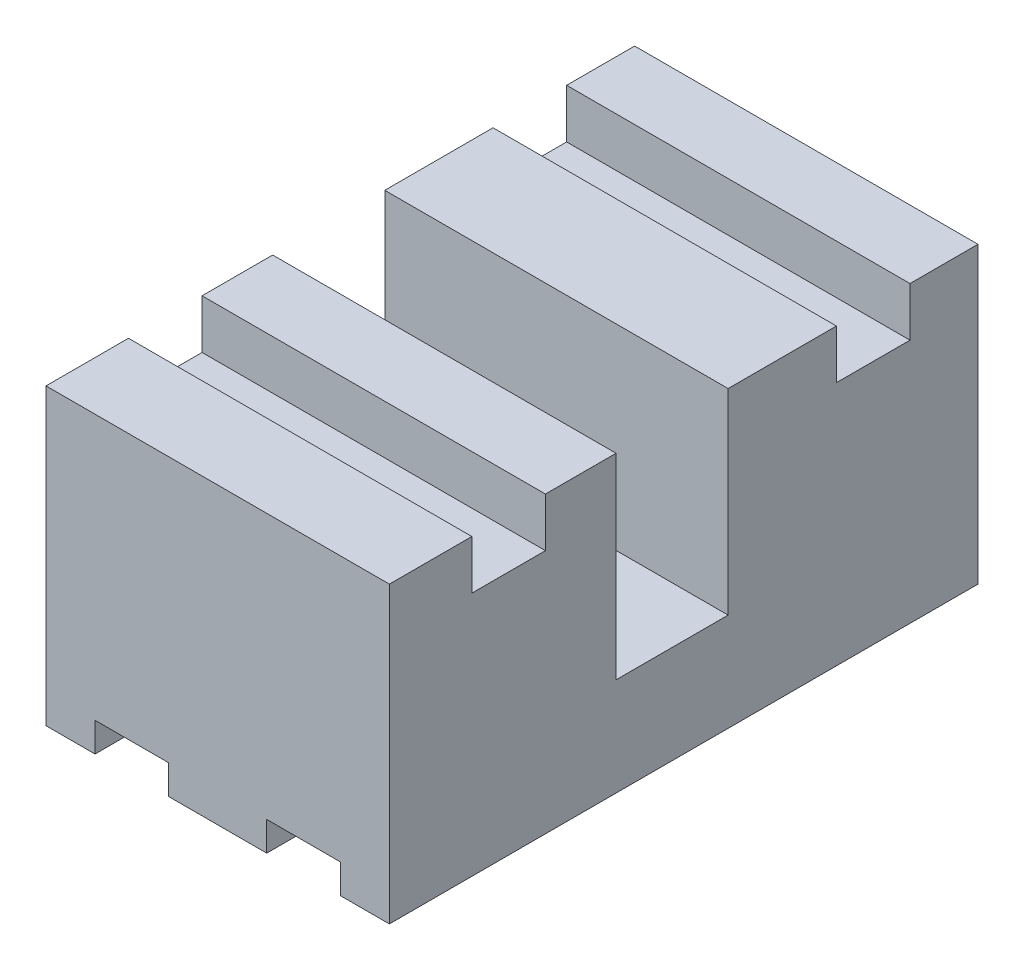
ISO-10303-21;
HEADER;
FILE_DESCRIPTION(('STEP AP214'),'2;1');
FILE_NAME('part.step','',(''),(''),'','','');
FILE_SCHEMA(('AUTOMOTIVE_DESIGN { 1 0 10303 214 1 1 1 1 }'));
ENDSEC;
DATA;
#1=APPLICATION_CONTEXT('core data for automotive mechanical design processes');
#2=APPLICATION_PROTOCOL_DEFINITION('international standard','automotive_design',2000,#1);
#3=PRODUCT_CONTEXT('',#1,'mechanical');
#4=PRODUCT('Part','Part','',(#3));
#5=PRODUCT_RELATED_PRODUCT_CATEGORY('part','',(#4));
#6=PRODUCT_DEFINITION_FORMATION('','',#4);
#7=PRODUCT_DEFINITION_CONTEXT('part definition',#1,'design');
#8=PRODUCT_DEFINITION('design','',#6,#7);
#9=PRODUCT_DEFINITION_SHAPE('','',#8);
#10=(LENGTH_UNIT() NAMED_UNIT(*) SI_UNIT(.MILLI.,.METRE.));
#11=(NAMED_UNIT(*) PLANE_ANGLE_UNIT() SI_UNIT($,.RADIAN.));
#12=(NAMED_UNIT(*) SI_UNIT($,.STERADIAN.) SOLID_ANGLE_UNIT());
#13=UNCERTAINTY_MEASURE_WITH_UNIT(LENGTH_MEASURE(1.E-05),#10,'distance_accuracy_value','');
#14=(GEOMETRIC_REPRESENTATION_CONTEXT(3) GLOBAL_UNCERTAINTY_ASSIGNED_CONTEXT((#13)) GLOBAL_UNIT_ASSIGNED_CONTEXT((#10,
#11,#12)) REPRESENTATION_CONTEXT('',''));
#15=CARTESIAN_POINT('',(0.,0.,0.));
#16=DIRECTION('',(0.,0.,1.));
#17=DIRECTION('',(1.,0.,0.));
#18=AXIS2_PLACEMENT_3D('',#15,#16,#17);
#19=CARTESIAN_POINT('',(175.,50.,300.));
#20=DIRECTION('',(0.,-1.,0.));
#21=DIRECTION('',(1.,0.,0.));
#22=AXIS2_PLACEMENT_3D('',#19,#20,#21);
#23=PLANE('',#22);
#24=DIRECTION('',(0.,0.,-1.));
#25=VECTOR('',#24,1.);
#26=CARTESIAN_POINT('',(0.,50.,300.));
#27=LINE('',#26,#25);
#28=CARTESIAN_POINT('',(0.,50.,184.471740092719));
#29=VERTEX_POINT('',#28);
#30=CARTESIAN_POINT('',(0.,50.,127.352675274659));
#31=VERTEX_POINT('',#30);
#32=EDGE_CURVE('E11',#29,#31,#27,.T.);
#33=ORIENTED_EDGE('',*,*,#32,.F.);
#34=DIRECTION('',(-1.,0.,0.));
#35=VECTOR('',#34,1.);
#36=CARTESIAN_POINT('',(175.,50.,184.471740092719));
#37=LINE('',#36,#35);
#38=CARTESIAN_POINT('',(175.,50.,184.471740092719));
#39=VERTEX_POINT('',#38);
#40=EDGE_CURVE('E242',#39,#29,#37,.T.);
#41=ORIENTED_EDGE('',*,*,#40,.F.);
#42=DIRECTION('',(0.,0.,-1.));
#43=VECTOR('',#42,1.);
#44=CARTESIAN_POINT('',(175.,50.,300.));
#45=LINE('',#44,#43);
#46=CARTESIAN_POINT('',(175.,50.,127.352675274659));
#47=VERTEX_POINT('',#46);
#48=EDGE_CURVE('E153',#39,#47,#45,.T.);
#49=ORIENTED_EDGE('',*,*,#48,.T.);
#50=DIRECTION('',(-1.,0.,0.));
#51=VECTOR('',#50,1.);
#52=CARTESIAN_POINT('',(175.,50.,127.352675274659));
#53=LINE('',#52,#51);
#54=EDGE_CURVE('E189',#47,#31,#53,.T.);
#55=ORIENTED_EDGE('',*,*,#54,.T.);
#56=EDGE_LOOP('',(#33,#41,#49,#55));
#57=FACE_BOUND('',#56,.T.);
#58=ADVANCED_FACE('F32',(#57),#23,.F.);
#59=CARTESIAN_POINT('',(0.,50.,300.));
#60=DIRECTION('',(1.,0.,0.));
#61=DIRECTION('',(0.,1.,0.));
#62=AXIS2_PLACEMENT_3D('',#59,#60,#61);
#63=PLANE('',#62);
#64=DIRECTION('',(0.,-1.,0.));
#65=VECTOR('',#64,1.);
#66=CARTESIAN_POINT('',(0.,50.,0.));
#67=LINE('',#66,#65);
#68=CARTESIAN_POINT('',(0.,150.,0.));
#69=VERTEX_POINT('',#68);
#70=CARTESIAN_POINT('',(0.,0.,0.));
#71=VERTEX_POINT('',#70);
#72=EDGE_CURVE('E154',#69,#71,#67,.T.);
#73=ORIENTED_EDGE('',*,*,#72,.T.);
#74=DIRECTION('',(0.,0.,-1.));
#75=VECTOR('',#74,1.);
#76=CARTESIAN_POINT('',(0.,0.,300.));
#77=LINE('',#76,#75);
#78=CARTESIAN_POINT('',(0.,0.,300.));
#79=VERTEX_POINT('',#78);
#80=EDGE_CURVE('E40',#79,#71,#77,.T.);
#81=ORIENTED_EDGE('',*,*,#80,.F.);
#82=DIRECTION('',(0.,-1.,0.));
#83=VECTOR('',#82,1.);
#84=CARTESIAN_POINT('',(0.,50.,300.));
#85=LINE('',#84,#83);
#86=CARTESIAN_POINT('',(0.,150.,300.));
#87=VERTEX_POINT('',#86);
#88=EDGE_CURVE('E101',#87,#79,#85,.T.);
#89=ORIENTED_EDGE('',*,*,#88,.F.);
#90=DIRECTION('',(0.,0.,-1.));
#91=VECTOR('',#90,1.);
#92=CARTESIAN_POINT('',(0.,150.,300.));
#93=LINE('',#92,#91);
#94=CARTESIAN_POINT('',(0.,150.,257.965859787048));
#95=VERTEX_POINT('',#94);
#96=EDGE_CURVE('E433',#87,#95,#93,.T.);
#97=ORIENTED_EDGE('',*,*,#96,.T.);
#98=DIRECTION('',(0.,-1.,0.));
#99=VECTOR('',#98,1.);
#100=CARTESIAN_POINT('',(0.,150.,257.965859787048));
#101=LINE('',#100,#99);
#102=CARTESIAN_POINT('',(0.,125.,257.965859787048));
#103=VERTEX_POINT('',#102);
#104=EDGE_CURVE('E436',#95,#103,#101,.T.);
#105=ORIENTED_EDGE('',*,*,#104,.T.);
#106=DIRECTION('',(0.,0.,-1.));
#107=VECTOR('',#106,1.);
#108=CARTESIAN_POINT('',(0.,125.,257.965859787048));
#109=LINE('',#108,#107);
#110=CARTESIAN_POINT('',(0.,125.,220.465859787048));
#111=VERTEX_POINT('',#110);
#112=EDGE_CURVE('E439',#103,#111,#109,.T.);
#113=ORIENTED_EDGE('',*,*,#112,.T.);
#114=DIRECTION('',(0.,1.,0.));
#115=VECTOR('',#114,1.);
#116=CARTESIAN_POINT('',(0.,125.,220.465859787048));
#117=LINE('',#116,#115);
#118=CARTESIAN_POINT('',(0.,150.,220.465859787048));
#119=VERTEX_POINT('',#118);
#120=EDGE_CURVE('E442',#111,#119,#117,.T.);
#121=ORIENTED_EDGE('',*,*,#120,.T.);
#122=DIRECTION('',(0.,0.,-1.));
#123=VECTOR('',#122,1.);
#124=CARTESIAN_POINT('',(0.,150.,220.465859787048));
#125=LINE('',#124,#123);
#126=CARTESIAN_POINT('',(0.,150.,184.471740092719));
#127=VERTEX_POINT('',#126);
#128=EDGE_CURVE('E415',#119,#127,#125,.T.);
#129=ORIENTED_EDGE('',*,*,#128,.T.);
#130=DIRECTION('',(0.,-1.,0.));
#131=VECTOR('',#130,1.);
#132=CARTESIAN_POINT('',(0.,150.,184.471740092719));
#133=LINE('',#132,#131);
#134=EDGE_CURVE('E259',#127,#29,#133,.T.);
#135=ORIENTED_EDGE('',*,*,#134,.T.);
#136=ORIENTED_EDGE('',*,*,#32,.T.);
#137=DIRECTION('',(0.,1.,0.));
#138=VECTOR('',#137,1.);
#139=CARTESIAN_POINT('',(0.,150.,127.352675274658));
#140=LINE('',#139,#138);
#141=CARTESIAN_POINT('',(0.,150.,127.352675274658));
#142=VERTEX_POINT('',#141);
#143=EDGE_CURVE('E240',#31,#142,#140,.T.);
#144=ORIENTED_EDGE('',*,*,#143,.T.);
#145=DIRECTION('',(0.,0.,-1.));
#146=VECTOR('',#145,1.);
#147=CARTESIAN_POINT('',(0.,150.,72.1566484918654));
#148=LINE('',#147,#146);
#149=CARTESIAN_POINT('',(0.,150.,72.1566484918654));
#150=VERTEX_POINT('',#149);
#151=EDGE_CURVE('E241',#142,#150,#148,.T.);
#152=ORIENTED_EDGE('',*,*,#151,.T.);
#153=DIRECTION('',(0.,-1.,0.));
#154=VECTOR('',#153,1.);
#155=CARTESIAN_POINT('',(0.,125.,72.1566484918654));
#156=LINE('',#155,#154);
#157=CARTESIAN_POINT('',(0.,125.,72.1566484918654));
#158=VERTEX_POINT('',#157);
#159=EDGE_CURVE('E245',#150,#158,#156,.T.);
#160=ORIENTED_EDGE('',*,*,#159,.T.);
#161=DIRECTION('',(0.,0.,-1.));
#162=VECTOR('',#161,1.);
#163=CARTESIAN_POINT('',(0.,125.,34.6566484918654));
#164=LINE('',#163,#162);
#165=CARTESIAN_POINT('',(0.,125.,34.6566484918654));
#166=VERTEX_POINT('',#165);
#167=EDGE_CURVE('E291',#158,#166,#164,.T.);
#168=ORIENTED_EDGE('',*,*,#167,.T.);
#169=DIRECTION('',(0.,1.,0.));
#170=VECTOR('',#169,1.);
#171=CARTESIAN_POINT('',(0.,150.,34.6566484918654));
#172=LINE('',#171,#170);
#173=CARTESIAN_POINT('',(0.,150.,34.6566484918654));
#174=VERTEX_POINT('',#173);
#175=EDGE_CURVE('E294',#166,#174,#172,.T.);
#176=ORIENTED_EDGE('',*,*,#175,.T.);
#177=DIRECTION('',(0.,0.,-1.));
#178=VECTOR('',#177,1.);
#179=CARTESIAN_POINT('',(0.,150.,0.));
#180=LINE('',#179,#178);
#181=EDGE_CURVE('E188',#174,#69,#180,.T.);
#182=ORIENTED_EDGE('',*,*,#181,.T.);
#183=EDGE_LOOP('',(#73,#81,#89,#97,#105,#113,#121,#129,#135,#136,#144,#152,#160,#168,#176,#182));
#184=FACE_BOUND('',#183,.T.);
#185=ADVANCED_FACE('F327',(#184),#63,.F.);
#186=CARTESIAN_POINT('',(0.,0.,300.));
#187=DIRECTION('',(0.,1.,0.));
#188=DIRECTION('',(0.,0.,1.));
#189=AXIS2_PLACEMENT_3D('',#186,#187,#188);
#190=PLANE('',#189);
#191=DIRECTION('',(1.,0.,0.));
#192=VECTOR('',#191,1.);
#193=CARTESIAN_POINT('',(0.,0.,0.));
#194=LINE('',#193,#192);
#195=CARTESIAN_POINT('',(25.,0.,0.));
#196=VERTEX_POINT('',#195);
#197=EDGE_CURVE('E156',#71,#196,#194,.T.);
#198=ORIENTED_EDGE('',*,*,#197,.T.);
#199=DIRECTION('',(0.,0.,-1.));
#200=VECTOR('',#199,1.);
#201=CARTESIAN_POINT('',(25.,0.,300.));
#202=LINE('',#201,#200);
#203=CARTESIAN_POINT('',(25.,0.,300.));
#204=VERTEX_POINT('',#203);
#205=EDGE_CURVE('E235',#204,#196,#202,.T.);
#206=ORIENTED_EDGE('',*,*,#205,.F.);
#207=DIRECTION('',(1.,0.,0.));
#208=VECTOR('',#207,1.);
#209=CARTESIAN_POINT('',(0.,0.,300.));
#210=LINE('',#209,#208);
#211=EDGE_CURVE('E202',#79,#204,#210,.T.);
#212=ORIENTED_EDGE('',*,*,#211,.F.);
#213=ORIENTED_EDGE('',*,*,#80,.T.);
#214=EDGE_LOOP('',(#198,#206,#212,#213));
#215=FACE_BOUND('',#214,.T.);
#216=ADVANCED_FACE('F469',(#215),#190,.F.);
#217=CARTESIAN_POINT('',(25.,0.,300.));
#218=DIRECTION('',(-1.,0.,0.));
#219=DIRECTION('',(0.,0.,1.));
#220=AXIS2_PLACEMENT_3D('',#217,#218,#219);
#221=PLANE('',#220);
#222=DIRECTION('',(0.,1.,0.));
#223=VECTOR('',#222,1.);
#224=CARTESIAN_POINT('',(25.,0.,0.));
#225=LINE('',#224,#223);
#226=CARTESIAN_POINT('',(25.,14.8994379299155,0.));
#227=VERTEX_POINT('',#226);
#228=EDGE_CURVE('E159',#196,#227,#225,.T.);
#229=ORIENTED_EDGE('',*,*,#228,.T.);
#230=DIRECTION('',(0.,0.,-1.));
#231=VECTOR('',#230,1.);
#232=CARTESIAN_POINT('',(25.,14.8994379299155,300.));
#233=LINE('',#232,#231);
#234=CARTESIAN_POINT('',(25.,14.8994379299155,300.));
#235=VERTEX_POINT('',#234);
#236=EDGE_CURVE('E232',#235,#227,#233,.T.);
#237=ORIENTED_EDGE('',*,*,#236,.F.);
#238=DIRECTION('',(0.,1.,0.));
#239=VECTOR('',#238,1.);
#240=CARTESIAN_POINT('',(25.,0.,300.));
#241=LINE('',#240,#239);
#242=EDGE_CURVE('E204',#204,#235,#241,.T.);
#243=ORIENTED_EDGE('',*,*,#242,.F.);
#244=ORIENTED_EDGE('',*,*,#205,.T.);
#245=EDGE_LOOP('',(#229,#237,#243,#244));
#246=FACE_BOUND('',#245,.T.);
#247=ADVANCED_FACE('F473',(#246),#221,.F.);
#248=CARTESIAN_POINT('',(25.,14.8994379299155,300.));
#249=DIRECTION('',(0.,1.,0.));
#250=DIRECTION('',(0.,0.,1.));
#251=AXIS2_PLACEMENT_3D('',#248,#249,#250);
#252=PLANE('',#251);
#253=DIRECTION('',(1.,0.,0.));
#254=VECTOR('',#253,1.);
#255=CARTESIAN_POINT('',(25.,14.8994379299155,0.));
#256=LINE('',#255,#254);
#257=CARTESIAN_POINT('',(62.5,14.8994379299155,0.));
#258=VERTEX_POINT('',#257);
#259=EDGE_CURVE('E161',#227,#258,#256,.T.);
#260=ORIENTED_EDGE('',*,*,#259,.T.);
#261=DIRECTION('',(0.,0.,-1.));
#262=VECTOR('',#261,1.);
#263=CARTESIAN_POINT('',(62.5,14.8994379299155,300.));
#264=LINE('',#263,#262);
#265=CARTESIAN_POINT('',(62.5,14.8994379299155,300.));
#266=VERTEX_POINT('',#265);
#267=EDGE_CURVE('E229',#266,#258,#264,.T.);
#268=ORIENTED_EDGE('',*,*,#267,.F.);
#269=DIRECTION('',(1.,0.,0.));
#270=VECTOR('',#269,1.);
#271=CARTESIAN_POINT('',(25.,14.8994379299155,300.));
#272=LINE('',#271,#270);
#273=EDGE_CURVE('E206',#235,#266,#272,.T.);
#274=ORIENTED_EDGE('',*,*,#273,.F.);
#275=ORIENTED_EDGE('',*,*,#236,.T.);
#276=EDGE_LOOP('',(#260,#268,#274,#275));
#277=FACE_BOUND('',#276,.T.);
#278=ADVANCED_FACE('F479',(#277),#252,.F.);
#279=CARTESIAN_POINT('',(62.5,14.8994379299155,300.));
#280=DIRECTION('',(1.,0.,0.));
#281=DIRECTION('',(0.,1.,0.));
#282=AXIS2_PLACEMENT_3D('',#279,#280,#281);
#283=PLANE('',#282);
#284=DIRECTION('',(0.,-1.,0.));
#285=VECTOR('',#284,1.);
#286=CARTESIAN_POINT('',(62.5,14.8994379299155,0.));
#287=LINE('',#286,#285);
#288=CARTESIAN_POINT('',(62.5,0.,0.));
#289=VERTEX_POINT('',#288);
#290=EDGE_CURVE('E163',#258,#289,#287,.T.);
#291=ORIENTED_EDGE('',*,*,#290,.T.);
#292=DIRECTION('',(0.,0.,-1.));
#293=VECTOR('',#292,1.);
#294=CARTESIAN_POINT('',(62.5,0.,300.));
#295=LINE('',#294,#293);
#296=CARTESIAN_POINT('',(62.5,0.,300.));
#297=VERTEX_POINT('',#296);
#298=EDGE_CURVE('E223',#297,#289,#295,.T.);
#299=ORIENTED_EDGE('',*,*,#298,.F.);
#300=DIRECTION('',(0.,-1.,0.));
#301=VECTOR('',#300,1.);
#302=CARTESIAN_POINT('',(62.5,14.8994379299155,300.));
#303=LINE('',#302,#301);
#304=EDGE_CURVE('E208',#266,#297,#303,.T.);
#305=ORIENTED_EDGE('',*,*,#304,.F.);
#306=ORIENTED_EDGE('',*,*,#267,.T.);
#307=EDGE_LOOP('',(#291,#299,#305,#306));
#308=FACE_BOUND('',#307,.T.);
#309=ADVANCED_FACE('F483',(#308),#283,.F.);
#310=CARTESIAN_POINT('',(62.5,0.,300.));
#311=DIRECTION('',(0.,1.,0.));
#312=DIRECTION('',(0.,0.,1.));
#313=AXIS2_PLACEMENT_3D('',#310,#311,#312);
#314=PLANE('',#313);
#315=DIRECTION('',(1.,0.,0.));
#316=VECTOR('',#315,1.);
#317=CARTESIAN_POINT('',(62.5,0.,0.));
#318=LINE('',#317,#316);
#319=CARTESIAN_POINT('',(112.5,0.,0.));
#320=VERTEX_POINT('',#319);
#321=EDGE_CURVE('E165',#289,#320,#318,.T.);
#322=ORIENTED_EDGE('',*,*,#321,.T.);
#323=DIRECTION('',(0.,0.,-1.));
#324=VECTOR('',#323,1.);
#325=CARTESIAN_POINT('',(112.5,0.,300.));
#326=LINE('',#325,#324);
#327=CARTESIAN_POINT('',(112.5,0.,300.));
#328=VERTEX_POINT('',#327);
#329=EDGE_CURVE('E218',#328,#320,#326,.T.);
#330=ORIENTED_EDGE('',*,*,#329,.F.);
#331=DIRECTION('',(1.,0.,0.));
#332=VECTOR('',#331,1.);
#333=CARTESIAN_POINT('',(62.5,0.,300.));
#334=LINE('',#333,#332);
#335=EDGE_CURVE('E210',#297,#328,#334,.T.);
#336=ORIENTED_EDGE('',*,*,#335,.F.);
#337=ORIENTED_EDGE('',*,*,#298,.T.);
#338=EDGE_LOOP('',(#322,#330,#336,#337));
#339=FACE_BOUND('',#338,.T.);
#340=ADVANCED_FACE('F219',(#339),#314,.F.);
#341=CARTESIAN_POINT('',(112.5,0.,300.));
#342=DIRECTION('',(-1.,0.,0.));
#343=DIRECTION('',(0.,0.,1.));
#344=AXIS2_PLACEMENT_3D('',#341,#342,#343);
#345=PLANE('',#344);
#346=DIRECTION('',(0.,1.,0.));
#347=VECTOR('',#346,1.);
#348=CARTESIAN_POINT('',(112.5,0.,0.));
#349=LINE('',#348,#347);
#350=CARTESIAN_POINT('',(112.5,14.8994379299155,0.));
#351=VERTEX_POINT('',#350);
#352=EDGE_CURVE('E167',#320,#351,#349,.T.);
#353=ORIENTED_EDGE('',*,*,#352,.T.);
#354=DIRECTION('',(0.,0.,-1.));
#355=VECTOR('',#354,1.);
#356=CARTESIAN_POINT('',(112.5,14.8994379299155,300.));
#357=LINE('',#356,#355);
#358=CARTESIAN_POINT('',(112.5,14.8994379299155,300.));
#359=VERTEX_POINT('',#358);
#360=EDGE_CURVE('E143',#359,#351,#357,.T.);
#361=ORIENTED_EDGE('',*,*,#360,.F.);
#362=DIRECTION('',(0.,1.,0.));
#363=VECTOR('',#362,1.);
#364=CARTESIAN_POINT('',(112.5,0.,300.));
#365=LINE('',#364,#363);
#366=EDGE_CURVE('E131',#328,#359,#365,.T.);
#367=ORIENTED_EDGE('',*,*,#366,.F.);
#368=ORIENTED_EDGE('',*,*,#329,.T.);
#369=EDGE_LOOP('',(#353,#361,#367,#368));
#370=FACE_BOUND('',#369,.T.);
#371=ADVANCED_FACE('F225',(#370),#345,.F.);
#372=CARTESIAN_POINT('',(112.5,14.8994379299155,300.));
#373=DIRECTION('',(0.,1.,0.));
#374=DIRECTION('',(0.,0.,1.));
#375=AXIS2_PLACEMENT_3D('',#372,#373,#374);
#376=PLANE('',#375);
#377=DIRECTION('',(1.,0.,0.));
#378=VECTOR('',#377,1.);
#379=CARTESIAN_POINT('',(112.5,14.8994379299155,0.));
#380=LINE('',#379,#378);
#381=CARTESIAN_POINT('',(150.,14.8994379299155,0.));
#382=VERTEX_POINT('',#381);
#383=EDGE_CURVE('E140',#351,#382,#380,.T.);
#384=ORIENTED_EDGE('',*,*,#383,.T.);
#385=DIRECTION('',(0.,0.,-1.));
#386=VECTOR('',#385,1.);
#387=CARTESIAN_POINT('',(150.,14.8994379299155,300.));
#388=LINE('',#387,#386);
#389=CARTESIAN_POINT('',(150.,14.8994379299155,300.));
#390=VERTEX_POINT('',#389);
#391=EDGE_CURVE('E137',#390,#382,#388,.T.);
#392=ORIENTED_EDGE('',*,*,#391,.F.);
#393=DIRECTION('',(1.,0.,0.));
#394=VECTOR('',#393,1.);
#395=CARTESIAN_POINT('',(112.5,14.8994379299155,300.));
#396=LINE('',#395,#394);
#397=EDGE_CURVE('E124',#359,#390,#396,.T.);
#398=ORIENTED_EDGE('',*,*,#397,.F.);
#399=ORIENTED_EDGE('',*,*,#360,.T.);
#400=EDGE_LOOP('',(#384,#392,#398,#399));
#401=FACE_BOUND('',#400,.T.);
#402=ADVANCED_FACE('F138',(#401),#376,.F.);
#403=CARTESIAN_POINT('',(150.,14.8994379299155,300.));
#404=DIRECTION('',(1.,0.,0.));
#405=DIRECTION('',(0.,0.,-1.));
#406=AXIS2_PLACEMENT_3D('',#403,#404,#405);
#407=PLANE('',#406);
#408=DIRECTION('',(0.,-1.,0.));
#409=VECTOR('',#408,1.);
#410=CARTESIAN_POINT('',(150.,14.8994379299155,0.));
#411=LINE('',#410,#409);
#412=CARTESIAN_POINT('',(150.,0.,0.));
#413=VERTEX_POINT('',#412);
#414=EDGE_CURVE('E170',#382,#413,#411,.T.);
#415=ORIENTED_EDGE('',*,*,#414,.T.);
#416=DIRECTION('',(0.,0.,-1.));
#417=VECTOR('',#416,1.);
#418=CARTESIAN_POINT('',(150.,0.,300.));
#419=LINE('',#418,#417);
#420=CARTESIAN_POINT('',(150.,0.,300.));
#421=VERTEX_POINT('',#420);
#422=EDGE_CURVE('E144',#421,#413,#419,.T.);
#423=ORIENTED_EDGE('',*,*,#422,.F.);
#424=DIRECTION('',(0.,-1.,0.));
#425=VECTOR('',#424,1.);
#426=CARTESIAN_POINT('',(150.,14.8994379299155,300.));
#427=LINE('',#426,#425);
#428=EDGE_CURVE('E128',#390,#421,#427,.T.);
#429=ORIENTED_EDGE('',*,*,#428,.F.);
#430=ORIENTED_EDGE('',*,*,#391,.T.);
#431=EDGE_LOOP('',(#415,#423,#429,#430));
#432=FACE_BOUND('',#431,.T.);
#433=ADVANCED_FACE('F146',(#432),#407,.F.);
#434=CARTESIAN_POINT('',(150.,0.,300.));
#435=DIRECTION('',(0.,1.,0.));
#436=DIRECTION('',(0.,0.,1.));
#437=AXIS2_PLACEMENT_3D('',#434,#435,#436);
#438=PLANE('',#437);
#439=DIRECTION('',(1.,0.,0.));
#440=VECTOR('',#439,1.);
#441=CARTESIAN_POINT('',(150.,0.,0.));
#442=LINE('',#441,#440);
#443=CARTESIAN_POINT('',(175.,0.,0.));
#444=VERTEX_POINT('',#443);
#445=EDGE_CURVE('E93',#413,#444,#442,.T.);
#446=ORIENTED_EDGE('',*,*,#445,.T.);
#447=DIRECTION('',(0.,0.,-1.));
#448=VECTOR('',#447,1.);
#449=CARTESIAN_POINT('',(175.,0.,300.));
#450=LINE('',#449,#448);
#451=CARTESIAN_POINT('',(175.,0.,300.));
#452=VERTEX_POINT('',#451);
#453=EDGE_CURVE('E178',#452,#444,#450,.T.);
#454=ORIENTED_EDGE('',*,*,#453,.F.);
#455=DIRECTION('',(1.,0.,0.));
#456=VECTOR('',#455,1.);
#457=CARTESIAN_POINT('',(150.,0.,300.));
#458=LINE('',#457,#456);
#459=EDGE_CURVE('E54',#421,#452,#458,.T.);
#460=ORIENTED_EDGE('',*,*,#459,.F.);
#461=ORIENTED_EDGE('',*,*,#422,.T.);
#462=EDGE_LOOP('',(#446,#454,#460,#461));
#463=FACE_BOUND('',#462,.T.);
#464=ADVANCED_FACE('F496',(#463),#438,.F.);
#465=CARTESIAN_POINT('',(175.,0.,300.));
#466=DIRECTION('',(-1.,0.,0.));
#467=DIRECTION('',(0.,0.,1.));
#468=AXIS2_PLACEMENT_3D('',#465,#466,#467);
#469=PLANE('',#468);
#470=DIRECTION('',(0.,1.,0.));
#471=VECTOR('',#470,1.);
#472=CARTESIAN_POINT('',(175.,0.,0.));
#473=LINE('',#472,#471);
#474=CARTESIAN_POINT('',(175.,150.,0.));
#475=VERTEX_POINT('',#474);
#476=EDGE_CURVE('E173',#444,#475,#473,.T.);
#477=ORIENTED_EDGE('',*,*,#476,.T.);
#478=DIRECTION('',(0.,0.,-1.));
#479=VECTOR('',#478,1.);
#480=CARTESIAN_POINT('',(175.,150.,0.));
#481=LINE('',#480,#479);
#482=CARTESIAN_POINT('',(175.,150.,34.6566484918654));
#483=VERTEX_POINT('',#482);
#484=EDGE_CURVE('E194',#483,#475,#481,.T.);
#485=ORIENTED_EDGE('',*,*,#484,.F.);
#486=DIRECTION('',(0.,1.,0.));
#487=VECTOR('',#486,1.);
#488=CARTESIAN_POINT('',(175.,150.,34.6566484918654));
#489=LINE('',#488,#487);
#490=CARTESIAN_POINT('',(175.,125.,34.6566484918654));
#491=VERTEX_POINT('',#490);
#492=EDGE_CURVE('E284',#491,#483,#489,.T.);
#493=ORIENTED_EDGE('',*,*,#492,.F.);
#494=DIRECTION('',(0.,0.,-1.));
#495=VECTOR('',#494,1.);
#496=CARTESIAN_POINT('',(175.,125.,34.6566484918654));
#497=LINE('',#496,#495);
#498=CARTESIAN_POINT('',(175.,125.,72.1566484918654));
#499=VERTEX_POINT('',#498);
#500=EDGE_CURVE('E281',#499,#491,#497,.T.);
#501=ORIENTED_EDGE('',*,*,#500,.F.);
#502=DIRECTION('',(0.,-1.,0.));
#503=VECTOR('',#502,1.);
#504=CARTESIAN_POINT('',(175.,125.,72.1566484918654));
#505=LINE('',#504,#503);
#506=CARTESIAN_POINT('',(175.,150.,72.1566484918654));
#507=VERTEX_POINT('',#506);
#508=EDGE_CURVE('E278',#507,#499,#505,.T.);
#509=ORIENTED_EDGE('',*,*,#508,.F.);
#510=DIRECTION('',(0.,0.,-1.));
#511=VECTOR('',#510,1.);
#512=CARTESIAN_POINT('',(175.,150.,72.1566484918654));
#513=LINE('',#512,#511);
#514=CARTESIAN_POINT('',(175.,150.,127.352675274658));
#515=VERTEX_POINT('',#514);
#516=EDGE_CURVE('E187',#515,#507,#513,.T.);
#517=ORIENTED_EDGE('',*,*,#516,.F.);
#518=DIRECTION('',(0.,1.,0.));
#519=VECTOR('',#518,1.);
#520=CARTESIAN_POINT('',(175.,150.,127.352675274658));
#521=LINE('',#520,#519);
#522=EDGE_CURVE('E184',#47,#515,#521,.T.);
#523=ORIENTED_EDGE('',*,*,#522,.F.);
#524=ORIENTED_EDGE('',*,*,#48,.F.);
#525=DIRECTION('',(0.,-1.,0.));
#526=VECTOR('',#525,1.);
#527=CARTESIAN_POINT('',(175.,150.,184.471740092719));
#528=LINE('',#527,#526);
#529=CARTESIAN_POINT('',(175.,150.,184.471740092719));
#530=VERTEX_POINT('',#529);
#531=EDGE_CURVE('E275',#530,#39,#528,.T.);
#532=ORIENTED_EDGE('',*,*,#531,.F.);
#533=DIRECTION('',(0.,0.,-1.));
#534=VECTOR('',#533,1.);
#535=CARTESIAN_POINT('',(175.,150.,220.465859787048));
#536=LINE('',#535,#534);
#537=CARTESIAN_POINT('',(175.,150.,220.465859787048));
#538=VERTEX_POINT('',#537);
#539=EDGE_CURVE('E414',#538,#530,#536,.T.);
#540=ORIENTED_EDGE('',*,*,#539,.F.);
#541=DIRECTION('',(0.,1.,0.));
#542=VECTOR('',#541,1.);
#543=CARTESIAN_POINT('',(175.,125.,220.465859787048));
#544=LINE('',#543,#542);
#545=CARTESIAN_POINT('',(175.,125.,220.465859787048));
#546=VERTEX_POINT('',#545);
#547=EDGE_CURVE('E422',#546,#538,#544,.T.);
#548=ORIENTED_EDGE('',*,*,#547,.F.);
#549=DIRECTION('',(0.,0.,-1.));
#550=VECTOR('',#549,1.);
#551=CARTESIAN_POINT('',(175.,125.,257.965859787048));
#552=LINE('',#551,#550);
#553=CARTESIAN_POINT('',(175.,125.,257.965859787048));
#554=VERTEX_POINT('',#553);
#555=EDGE_CURVE('E426',#554,#546,#552,.T.);
#556=ORIENTED_EDGE('',*,*,#555,.F.);
#557=DIRECTION('',(0.,-1.,0.));
#558=VECTOR('',#557,1.);
#559=CARTESIAN_POINT('',(175.,150.,257.965859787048));
#560=LINE('',#559,#558);
#561=CARTESIAN_POINT('',(175.,150.,257.965859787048));
#562=VERTEX_POINT('',#561);
#563=EDGE_CURVE('E428',#562,#554,#560,.T.);
#564=ORIENTED_EDGE('',*,*,#563,.F.);
#565=DIRECTION('',(0.,0.,-1.));
#566=VECTOR('',#565,1.);
#567=CARTESIAN_POINT('',(175.,150.,300.));
#568=LINE('',#567,#566);
#569=CARTESIAN_POINT('',(175.,150.,300.));
#570=VERTEX_POINT('',#569);
#571=EDGE_CURVE('E443',#570,#562,#568,.T.);
#572=ORIENTED_EDGE('',*,*,#571,.F.);
#573=DIRECTION('',(0.,1.,0.));
#574=VECTOR('',#573,1.);
#575=CARTESIAN_POINT('',(175.,0.,300.));
#576=LINE('',#575,#574);
#577=EDGE_CURVE('E148',#452,#570,#576,.T.);
#578=ORIENTED_EDGE('',*,*,#577,.F.);
#579=ORIENTED_EDGE('',*,*,#453,.T.);
#580=EDGE_LOOP('',(#477,#485,#493,#501,#509,#517,#523,#524,#532,#540,#548,#556,#564,#572,#578,#579));
#581=FACE_BOUND('',#580,.T.);
#582=ADVANCED_FACE('F363',(#581),#469,.F.);
#583=CARTESIAN_POINT('',(0.,50.,300.));
#584=DIRECTION('',(0.,0.,1.));
#585=DIRECTION('',(1.,0.,0.));
#586=AXIS2_PLACEMENT_3D('',#583,#584,#585);
#587=PLANE('',#586);
#588=ORIENTED_EDGE('',*,*,#577,.T.);
#589=DIRECTION('',(-1.,0.,0.));
#590=VECTOR('',#589,1.);
#591=CARTESIAN_POINT('',(175.,150.,300.));
#592=LINE('',#591,#590);
#593=EDGE_CURVE('E273',#570,#87,#592,.T.);
#594=ORIENTED_EDGE('',*,*,#593,.T.);
#595=ORIENTED_EDGE('',*,*,#88,.T.);
#596=ORIENTED_EDGE('',*,*,#211,.T.);
#597=ORIENTED_EDGE('',*,*,#242,.T.);
#598=ORIENTED_EDGE('',*,*,#273,.T.);
#599=ORIENTED_EDGE('',*,*,#304,.T.);
#600=ORIENTED_EDGE('',*,*,#335,.T.);
#601=ORIENTED_EDGE('',*,*,#366,.T.);
#602=ORIENTED_EDGE('',*,*,#397,.T.);
#603=ORIENTED_EDGE('',*,*,#428,.T.);
#604=ORIENTED_EDGE('',*,*,#459,.T.);
#605=EDGE_LOOP('',(#588,#594,#595,#596,#597,#598,#599,#600,#601,#602,#603,#604));
#606=FACE_BOUND('',#605,.T.);
#607=ADVANCED_FACE('F126',(#606),#587,.T.);
#608=CARTESIAN_POINT('',(0.,50.,0.));
#609=DIRECTION('',(0.,0.,1.));
#610=DIRECTION('',(1.,0.,0.));
#611=AXIS2_PLACEMENT_3D('',#608,#609,#610);
#612=PLANE('',#611);
#613=ORIENTED_EDGE('',*,*,#72,.F.);
#614=DIRECTION('',(-1.,0.,0.));
#615=VECTOR('',#614,1.);
#616=CARTESIAN_POINT('',(175.,150.,0.));
#617=LINE('',#616,#615);
#618=EDGE_CURVE('E157',#475,#69,#617,.T.);
#619=ORIENTED_EDGE('',*,*,#618,.F.);
#620=ORIENTED_EDGE('',*,*,#476,.F.);
#621=ORIENTED_EDGE('',*,*,#445,.F.);
#622=ORIENTED_EDGE('',*,*,#414,.F.);
#623=ORIENTED_EDGE('',*,*,#383,.F.);
#624=ORIENTED_EDGE('',*,*,#352,.F.);
#625=ORIENTED_EDGE('',*,*,#321,.F.);
#626=ORIENTED_EDGE('',*,*,#290,.F.);
#627=ORIENTED_EDGE('',*,*,#259,.F.);
#628=ORIENTED_EDGE('',*,*,#228,.F.);
#629=ORIENTED_EDGE('',*,*,#197,.F.);
#630=EDGE_LOOP('',(#613,#619,#620,#621,#622,#623,#624,#625,#626,#627,#628,#629));
#631=FACE_BOUND('',#630,.T.);
#632=ADVANCED_FACE('F366',(#631),#612,.F.);
#633=CARTESIAN_POINT('',(175.,150.,0.));
#634=DIRECTION('',(0.,1.,0.));
#635=DIRECTION('',(-1.,0.,0.));
#636=AXIS2_PLACEMENT_3D('',#633,#634,#635);
#637=PLANE('',#636);
#638=ORIENTED_EDGE('',*,*,#181,.F.);
#639=DIRECTION('',(-1.,0.,0.));
#640=VECTOR('',#639,1.);
#641=CARTESIAN_POINT('',(175.,150.,34.6566484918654));
#642=LINE('',#641,#640);
#643=EDGE_CURVE('E301',#483,#174,#642,.T.);
#644=ORIENTED_EDGE('',*,*,#643,.F.);
#645=ORIENTED_EDGE('',*,*,#484,.T.);
#646=ORIENTED_EDGE('',*,*,#618,.T.);
#647=EDGE_LOOP('',(#638,#644,#645,#646));
#648=FACE_BOUND('',#647,.T.);
#649=ADVANCED_FACE('F368',(#648),#637,.T.);
#650=CARTESIAN_POINT('',(175.,150.,34.6566484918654));
#651=DIRECTION('',(0.,0.,1.));
#652=DIRECTION('',(0.,-1.,0.));
#653=AXIS2_PLACEMENT_3D('',#650,#651,#652);
#654=PLANE('',#653);
#655=ORIENTED_EDGE('',*,*,#175,.F.);
#656=DIRECTION('',(-1.,0.,0.));
#657=VECTOR('',#656,1.);
#658=CARTESIAN_POINT('',(175.,125.,34.6566484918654));
#659=LINE('',#658,#657);
#660=EDGE_CURVE('E304',#491,#166,#659,.T.);
#661=ORIENTED_EDGE('',*,*,#660,.F.);
#662=ORIENTED_EDGE('',*,*,#492,.T.);
#663=ORIENTED_EDGE('',*,*,#643,.T.);
#664=EDGE_LOOP('',(#655,#661,#662,#663));
#665=FACE_BOUND('',#664,.T.);
#666=ADVANCED_FACE('F370',(#665),#654,.T.);
#667=CARTESIAN_POINT('',(175.,125.,34.6566484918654));
#668=DIRECTION('',(0.,1.,0.));
#669=DIRECTION('',(-1.,0.,0.));
#670=AXIS2_PLACEMENT_3D('',#667,#668,#669);
#671=PLANE('',#670);
#672=ORIENTED_EDGE('',*,*,#167,.F.);
#673=DIRECTION('',(-1.,0.,0.));
#674=VECTOR('',#673,1.);
#675=CARTESIAN_POINT('',(175.,125.,72.1566484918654));
#676=LINE('',#675,#674);
#677=EDGE_CURVE('E307',#499,#158,#676,.T.);
#678=ORIENTED_EDGE('',*,*,#677,.F.);
#679=ORIENTED_EDGE('',*,*,#500,.T.);
#680=ORIENTED_EDGE('',*,*,#660,.T.);
#681=EDGE_LOOP('',(#672,#678,#679,#680));
#682=FACE_BOUND('',#681,.T.);
#683=ADVANCED_FACE('F374',(#682),#671,.T.);
#684=CARTESIAN_POINT('',(175.,125.,72.1566484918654));
#685=DIRECTION('',(0.,0.,-1.));
#686=DIRECTION('',(-1.,0.,0.));
#687=AXIS2_PLACEMENT_3D('',#684,#685,#686);
#688=PLANE('',#687);
#689=ORIENTED_EDGE('',*,*,#159,.F.);
#690=DIRECTION('',(-1.,0.,0.));
#691=VECTOR('',#690,1.);
#692=CARTESIAN_POINT('',(175.,150.,72.1566484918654));
#693=LINE('',#692,#691);
#694=EDGE_CURVE('E309',#507,#150,#693,.T.);
#695=ORIENTED_EDGE('',*,*,#694,.F.);
#696=ORIENTED_EDGE('',*,*,#508,.T.);
#697=ORIENTED_EDGE('',*,*,#677,.T.);
#698=EDGE_LOOP('',(#689,#695,#696,#697));
#699=FACE_BOUND('',#698,.T.);
#700=ADVANCED_FACE('F376',(#699),#688,.T.);
#701=CARTESIAN_POINT('',(175.,150.,72.1566484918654));
#702=DIRECTION('',(0.,1.,0.));
#703=DIRECTION('',(0.,0.,1.));
#704=AXIS2_PLACEMENT_3D('',#701,#702,#703);
#705=PLANE('',#704);
#706=ORIENTED_EDGE('',*,*,#151,.F.);
#707=DIRECTION('',(-1.,0.,0.));
#708=VECTOR('',#707,1.);
#709=CARTESIAN_POINT('',(175.,150.,127.352675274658));
#710=LINE('',#709,#708);
#711=EDGE_CURVE('E193',#515,#142,#710,.T.);
#712=ORIENTED_EDGE('',*,*,#711,.F.);
#713=ORIENTED_EDGE('',*,*,#516,.T.);
#714=ORIENTED_EDGE('',*,*,#694,.T.);
#715=EDGE_LOOP('',(#706,#712,#713,#714));
#716=FACE_BOUND('',#715,.T.);
#717=ADVANCED_FACE('F326',(#716),#705,.T.);
#718=CARTESIAN_POINT('',(175.,150.,127.352675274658));
#719=DIRECTION('',(0.,0.,1.));
#720=DIRECTION('',(0.,-1.,0.));
#721=AXIS2_PLACEMENT_3D('',#718,#719,#720);
#722=PLANE('',#721);
#723=ORIENTED_EDGE('',*,*,#143,.F.);
#724=ORIENTED_EDGE('',*,*,#54,.F.);
#725=ORIENTED_EDGE('',*,*,#522,.T.);
#726=ORIENTED_EDGE('',*,*,#711,.T.);
#727=EDGE_LOOP('',(#723,#724,#725,#726));
#728=FACE_BOUND('',#727,.T.);
#729=ADVANCED_FACE('F319',(#728),#722,.T.);
#730=CARTESIAN_POINT('',(175.,150.,184.471740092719));
#731=DIRECTION('',(0.,0.,-1.));
#732=DIRECTION('',(0.,1.,0.));
#733=AXIS2_PLACEMENT_3D('',#730,#731,#732);
#734=PLANE('',#733);
#735=ORIENTED_EDGE('',*,*,#134,.F.);
#736=DIRECTION('',(-1.,0.,0.));
#737=VECTOR('',#736,1.);
#738=CARTESIAN_POINT('',(175.,150.,184.471740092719));
#739=LINE('',#738,#737);
#740=EDGE_CURVE('E248',#530,#127,#739,.T.);
#741=ORIENTED_EDGE('',*,*,#740,.F.);
#742=ORIENTED_EDGE('',*,*,#531,.T.);
#743=ORIENTED_EDGE('',*,*,#40,.T.);
#744=EDGE_LOOP('',(#735,#741,#742,#743));
#745=FACE_BOUND('',#744,.T.);
#746=ADVANCED_FACE('F507',(#745),#734,.T.);
#747=CARTESIAN_POINT('',(175.,150.,220.465859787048));
#748=DIRECTION('',(0.,1.,0.));
#749=DIRECTION('',(-1.,0.,0.));
#750=AXIS2_PLACEMENT_3D('',#747,#748,#749);
#751=PLANE('',#750);
#752=ORIENTED_EDGE('',*,*,#128,.F.);
#753=DIRECTION('',(-1.,0.,0.));
#754=VECTOR('',#753,1.);
#755=CARTESIAN_POINT('',(175.,150.,220.465859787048));
#756=LINE('',#755,#754);
#757=EDGE_CURVE('E256',#538,#119,#756,.T.);
#758=ORIENTED_EDGE('',*,*,#757,.F.);
#759=ORIENTED_EDGE('',*,*,#539,.T.);
#760=ORIENTED_EDGE('',*,*,#740,.T.);
#761=EDGE_LOOP('',(#752,#758,#759,#760));
#762=FACE_BOUND('',#761,.T.);
#763=ADVANCED_FACE('F413',(#762),#751,.T.);
#764=CARTESIAN_POINT('',(175.,125.,220.465859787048));
#765=DIRECTION('',(0.,0.,1.));
#766=DIRECTION('',(1.,0.,0.));
#767=AXIS2_PLACEMENT_3D('',#764,#765,#766);
#768=PLANE('',#767);
#769=ORIENTED_EDGE('',*,*,#120,.F.);
#770=DIRECTION('',(-1.,0.,0.));
#771=VECTOR('',#770,1.);
#772=CARTESIAN_POINT('',(175.,125.,220.465859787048));
#773=LINE('',#772,#771);
#774=EDGE_CURVE('E264',#546,#111,#773,.T.);
#775=ORIENTED_EDGE('',*,*,#774,.F.);
#776=ORIENTED_EDGE('',*,*,#547,.T.);
#777=ORIENTED_EDGE('',*,*,#757,.T.);
#778=EDGE_LOOP('',(#769,#775,#776,#777));
#779=FACE_BOUND('',#778,.T.);
#780=ADVANCED_FACE('F425',(#779),#768,.T.);
#781=CARTESIAN_POINT('',(175.,125.,257.965859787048));
#782=DIRECTION('',(0.,1.,0.));
#783=DIRECTION('',(-1.,0.,0.));
#784=AXIS2_PLACEMENT_3D('',#781,#782,#783);
#785=PLANE('',#784);
#786=ORIENTED_EDGE('',*,*,#112,.F.);
#787=DIRECTION('',(-1.,0.,0.));
#788=VECTOR('',#787,1.);
#789=CARTESIAN_POINT('',(175.,125.,257.965859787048));
#790=LINE('',#789,#788);
#791=EDGE_CURVE('E267',#554,#103,#790,.T.);
#792=ORIENTED_EDGE('',*,*,#791,.F.);
#793=ORIENTED_EDGE('',*,*,#555,.T.);
#794=ORIENTED_EDGE('',*,*,#774,.T.);
#795=EDGE_LOOP('',(#786,#792,#793,#794));
#796=FACE_BOUND('',#795,.T.);
#797=ADVANCED_FACE('F455',(#796),#785,.T.);
#798=CARTESIAN_POINT('',(175.,150.,257.965859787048));
#799=DIRECTION('',(0.,0.,-1.));
#800=DIRECTION('',(-1.,0.,0.));
#801=AXIS2_PLACEMENT_3D('',#798,#799,#800);
#802=PLANE('',#801);
#803=ORIENTED_EDGE('',*,*,#104,.F.);
#804=DIRECTION('',(-1.,0.,0.));
#805=VECTOR('',#804,1.);
#806=CARTESIAN_POINT('',(175.,150.,257.965859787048));
#807=LINE('',#806,#805);
#808=EDGE_CURVE('E270',#562,#95,#807,.T.);
#809=ORIENTED_EDGE('',*,*,#808,.F.);
#810=ORIENTED_EDGE('',*,*,#563,.T.);
#811=ORIENTED_EDGE('',*,*,#791,.T.);
#812=EDGE_LOOP('',(#803,#809,#810,#811));
#813=FACE_BOUND('',#812,.T.);
#814=ADVANCED_FACE('F452',(#813),#802,.T.);
#815=CARTESIAN_POINT('',(175.,150.,300.));
#816=DIRECTION('',(0.,1.,0.));
#817=DIRECTION('',(-1.,0.,0.));
#818=AXIS2_PLACEMENT_3D('',#815,#816,#817);
#819=PLANE('',#818);
#820=ORIENTED_EDGE('',*,*,#96,.F.);
#821=ORIENTED_EDGE('',*,*,#593,.F.);
#822=ORIENTED_EDGE('',*,*,#571,.T.);
#823=ORIENTED_EDGE('',*,*,#808,.T.);
#824=EDGE_LOOP('',(#820,#821,#822,#823));
#825=FACE_BOUND('',#824,.T.);
#826=ADVANCED_FACE('F457',(#825),#819,.T.);
#827=CLOSED_SHELL('',(#58,#185,#216,#247,#278,#309,#340,#371,#402,#433,#464,#582,#607,#632,#649,
#666,#683,#700,#717,#729,#746,#763,#780,#797,#814,#826));
#828=MANIFOLD_SOLID_BREP('B2',#827);
#829=ADVANCED_BREP_SHAPE_REPRESENTATION('',(#18,#828),#14);
#830=SHAPE_DEFINITION_REPRESENTATION(#9,#829);
ENDSEC;
END-ISO-10303-21;
